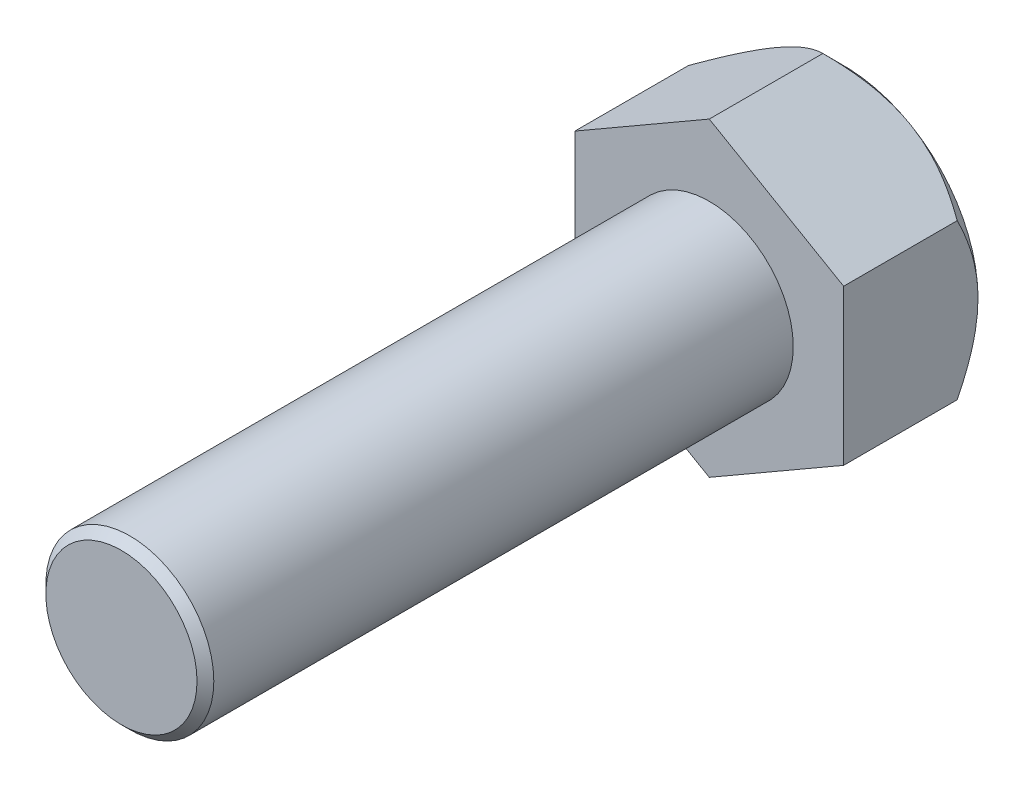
from build123d import *

# Parameters (mm, degrees)
SZKIC1_R                    = 5
DODANIE_WYCI_GNI_CIE1_DEPTH = 35
SFAZOWANIE1_SIZE            = 0.5
DODANIE_WYCI_GNI_CIE2_DEPTH = 8
SZKIC3_OUTSIDE_W            = 119.298
SZKIC3_OUTSIDE_H            = 121.774
SZKIC3_OUTSIDE_R            = 8
WYTNIJ_WYCI_GNI_CIE1_DEPTH  = 45.702721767
WYTNIJ_WYCI_GNI_CIE1_DRAFT  = -45


with BuildPart() as part:
    # Szkic1 → Dodanie-wyci_gni_cie1 (new body)
    with BuildSketch(Plane.XY):
        Circle(SZKIC1_R)
    extrude(amount=DODANIE_WYCI_GNI_CIE1_DEPTH)

    # Sfazowanie1
    sfazowanie1_edges = [part.edges().sort_by_distance(p)[0] for p in [
        (-5, 0, 35),
    ]]
    chamfer(sfazowanie1_edges, length=SFAZOWANIE1_SIZE)

    # Szkic2 → Dodanie-wyci_gni_cie2 (add)
    with BuildSketch(Plane(origin=(0, 0, 0), x_dir=(-1, 0, 0), z_dir=(0, 0, -1))):
        Polygon((-8, 4.618802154), (-8, -4.618802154), (0, -9.237604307), (8, -4.618802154), (8, 4.618802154), (0, 9.237604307), align=None)
    extrude(amount=DODANIE_WYCI_GNI_CIE2_DEPTH)


with BuildPart() as wytnij_wyci_gni_cie1_tool:
    # Szkic3 outside → Wytnij-wyci_gni_cie1 (with draft: the straight prism first)
    with BuildSketch(Plane(origin=(0, 0, -8), x_dir=(-1, 0, 0), z_dir=(0, 0, -1))):
        Rectangle(SZKIC3_OUTSIDE_W, SZKIC3_OUTSIDE_H)
        Circle(SZKIC3_OUTSIDE_R, mode=Mode.SUBTRACT)
    extrude(amount=-WYTNIJ_WYCI_GNI_CIE1_DEPTH)
    # Wytnij-wyci_gni_cie1: the draft: its side faces are tilted about the plane it starts from
    wytnij_wyci_gni_cie1_sides = [wytnij_wyci_gni_cie1_tool.faces().sort_by_distance(p)[0] for p in [
        (0, -60.887, 14.851360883),
        (-59.649, 0, 14.851360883),
        (0, 60.887, 14.851360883),
        (59.649, 0, 14.851360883),
        (8, 0, 14.851360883),
    ]]
    draft(wytnij_wyci_gni_cie1_sides, Plane(origin=(0, 0, -8), x_dir=(-1, 0, 0), z_dir=(0, 0, -1)), WYTNIJ_WYCI_GNI_CIE1_DRAFT)


with BuildPart() as part_1:
    add(part.part)

    # Wytnij-wyci_gni_cie1: cut by wytnij_wyci_gni_cie1_tool
    add(wytnij_wyci_gni_cie1_tool.part, mode=Mode.SUBTRACT)


solid = part_1.part
